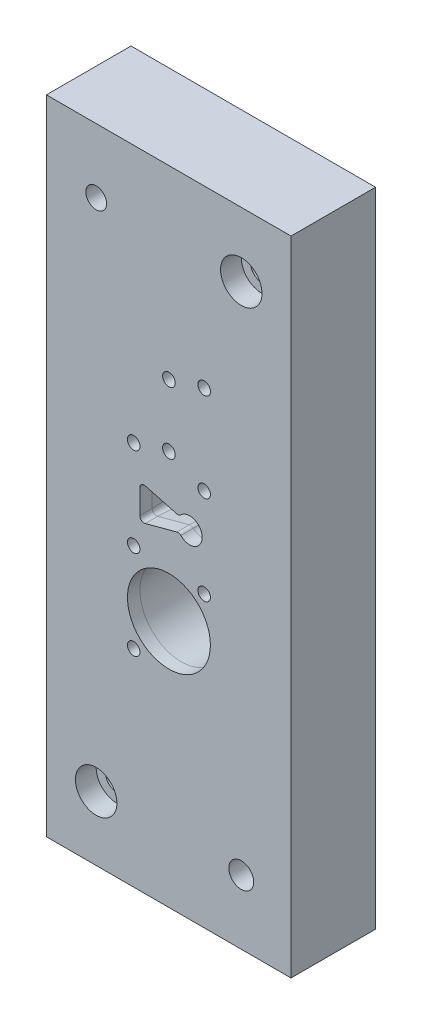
ISO-10303-21;
HEADER;
FILE_DESCRIPTION(('STEP AP214'),'2;1');
FILE_NAME('part.step','',(''),(''),'','','');
FILE_SCHEMA(('AUTOMOTIVE_DESIGN { 1 0 10303 214 1 1 1 1 }'));
ENDSEC;
DATA;
#1=APPLICATION_CONTEXT('core data for automotive mechanical design processes');
#2=APPLICATION_PROTOCOL_DEFINITION('international standard','automotive_design',2000,#1);
#3=PRODUCT_CONTEXT('',#1,'mechanical');
#4=PRODUCT('Part','Part','',(#3));
#5=PRODUCT_RELATED_PRODUCT_CATEGORY('part','',(#4));
#6=PRODUCT_DEFINITION_FORMATION('','',#4);
#7=PRODUCT_DEFINITION_CONTEXT('part definition',#1,'design');
#8=PRODUCT_DEFINITION('design','',#6,#7);
#9=PRODUCT_DEFINITION_SHAPE('','',#8);
#10=(LENGTH_UNIT() NAMED_UNIT(*) SI_UNIT(.MILLI.,.METRE.));
#11=(NAMED_UNIT(*) PLANE_ANGLE_UNIT() SI_UNIT($,.RADIAN.));
#12=(NAMED_UNIT(*) SI_UNIT($,.STERADIAN.) SOLID_ANGLE_UNIT());
#13=UNCERTAINTY_MEASURE_WITH_UNIT(LENGTH_MEASURE(1.E-05),#10,'distance_accuracy_value','');
#14=(GEOMETRIC_REPRESENTATION_CONTEXT(3) GLOBAL_UNCERTAINTY_ASSIGNED_CONTEXT((#13)) GLOBAL_UNIT_ASSIGNED_CONTEXT((#10,
#11,#12)) REPRESENTATION_CONTEXT('',''));
#15=CARTESIAN_POINT('',(0.,0.,0.));
#16=DIRECTION('',(0.,0.,1.));
#17=DIRECTION('',(1.,0.,0.));
#18=AXIS2_PLACEMENT_3D('',#15,#16,#17);
#19=CARTESIAN_POINT('',(29.5,77.5,20.4));
#20=DIRECTION('',(0.,0.,1.));
#21=DIRECTION('',(1.,0.,0.));
#22=AXIS2_PLACEMENT_3D('',#19,#20,#21);
#23=PLANE('',#22);
#24=CARTESIAN_POINT('',(-8.45000000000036,-27.667948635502,20.4));
#25=DIRECTION('',(0.,0.,1.));
#26=DIRECTION('',(1.,0.,0.));
#27=AXIS2_PLACEMENT_3D('',#24,#25,#26);
#28=CIRCLE('',#27,1.5035);
#29=CARTESIAN_POINT('',(-6.94650000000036,-27.667948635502,20.4));
#30=VERTEX_POINT('',#29);
#31=EDGE_CURVE('E558',#30,#30,#28,.T.);
#32=ORIENTED_EDGE('',*,*,#31,.F.);
#33=EDGE_LOOP('',(#32));
#34=FACE_BOUND('',#33,.T.);
#35=CARTESIAN_POINT('',(8.54999999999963,-7.7320513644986,20.4));
#36=DIRECTION('',(0.,0.,1.));
#37=DIRECTION('',(1.,0.,0.));
#38=AXIS2_PLACEMENT_3D('',#35,#36,#37);
#39=CIRCLE('',#38,1.5035);
#40=CARTESIAN_POINT('',(10.0534999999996,-7.7320513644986,20.4));
#41=VERTEX_POINT('',#40);
#42=EDGE_CURVE('E198',#41,#41,#39,.T.);
#43=ORIENTED_EDGE('',*,*,#42,.F.);
#44=EDGE_LOOP('',(#43));
#45=FACE_BOUND('',#44,.T.);
#46=CARTESIAN_POINT('',(2.22157287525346,6.62842712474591,20.4));
#47=DIRECTION('',(0.,0.,-1.));
#48=DIRECTION('',(1.,0.,0.));
#49=AXIS2_PLACEMENT_3D('',#46,#47,#48);
#50=CIRCLE('',#49,0.97);
#51=CARTESIAN_POINT('',(2.90746645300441,5.94253354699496,20.4));
#52=VERTEX_POINT('',#51);
#53=CARTESIAN_POINT('',(1.97051840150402,5.69147907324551,20.4));
#54=VERTEX_POINT('',#53);
#55=EDGE_CURVE('E56',#52,#54,#50,.T.);
#56=ORIENTED_EDGE('',*,*,#55,.F.);
#57=CARTESIAN_POINT('',(5.04999999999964,3.79999999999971,20.4));
#58=DIRECTION('',(0.,0.,1.));
#59=DIRECTION('',(1.,0.,0.));
#60=AXIS2_PLACEMENT_3D('',#57,#58,#59);
#61=CIRCLE('',#60,3.03);
#62=CARTESIAN_POINT('',(2.90746645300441,1.65746645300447,20.4));
#63=VERTEX_POINT('',#62);
#64=EDGE_CURVE('E166',#63,#52,#61,.T.);
#65=ORIENTED_EDGE('',*,*,#64,.F.);
#66=CARTESIAN_POINT('',(2.22157287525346,0.971572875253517,20.4));
#67=DIRECTION('',(0.,0.,-1.));
#68=DIRECTION('',(1.,0.,0.));
#69=AXIS2_PLACEMENT_3D('',#66,#67,#68);
#70=CIRCLE('',#69,0.97);
#71=CARTESIAN_POINT('',(1.97051840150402,1.90852092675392,20.4));
#72=VERTEX_POINT('',#71);
#73=EDGE_CURVE('E212',#72,#63,#70,.T.);
#74=ORIENTED_EDGE('',*,*,#73,.F.);
#75=DIRECTION('',(0.96592582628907,0.258819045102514,0.));
#76=VECTOR('',#75,1.);
#77=CARTESIAN_POINT('',(-5.68341638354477,-0.142344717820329,20.4));
#78=LINE('',#77,#76);
#79=CARTESIAN_POINT('',(-5.68341638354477,-0.142344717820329,20.4));
#80=VERTEX_POINT('',#79);
#81=EDGE_CURVE('E209',#80,#72,#78,.T.);
#82=ORIENTED_EDGE('',*,*,#81,.F.);
#83=CARTESIAN_POINT('',(-5.95000000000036,0.852558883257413,20.4));
#84=DIRECTION('',(0.,0.,1.));
#85=DIRECTION('',(1.,0.,0.));
#86=AXIS2_PLACEMENT_3D('',#83,#84,#85);
#87=CIRCLE('',#86,1.03);
#88=CARTESIAN_POINT('',(-6.98000000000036,0.852558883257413,20.4));
#89=VERTEX_POINT('',#88);
#90=EDGE_CURVE('E206',#89,#80,#87,.T.);
#91=ORIENTED_EDGE('',*,*,#90,.F.);
#92=DIRECTION('',(0.,-1.,0.));
#93=VECTOR('',#92,1.);
#94=CARTESIAN_POINT('',(-6.98000000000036,6.74744111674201,20.4));
#95=LINE('',#94,#93);
#96=CARTESIAN_POINT('',(-6.98000000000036,6.74744111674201,20.4));
#97=VERTEX_POINT('',#96);
#98=EDGE_CURVE('E203',#97,#89,#95,.T.);
#99=ORIENTED_EDGE('',*,*,#98,.F.);
#100=CARTESIAN_POINT('',(-5.95000000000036,6.74744111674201,20.4));
#101=DIRECTION('',(0.,0.,1.));
#102=DIRECTION('',(1.,0.,0.));
#103=AXIS2_PLACEMENT_3D('',#100,#101,#102);
#104=CIRCLE('',#103,1.03);
#105=CARTESIAN_POINT('',(-5.68341638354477,7.74234471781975,20.4));
#106=VERTEX_POINT('',#105);
#107=EDGE_CURVE('E200',#106,#97,#104,.T.);
#108=ORIENTED_EDGE('',*,*,#107,.F.);
#109=DIRECTION('',(-0.96592582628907,0.258819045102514,0.));
#110=VECTOR('',#109,1.);
#111=CARTESIAN_POINT('',(1.97051840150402,5.69147907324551,20.4));
#112=LINE('',#111,#110);
#113=EDGE_CURVE('E197',#54,#106,#112,.T.);
#114=ORIENTED_EDGE('',*,*,#113,.F.);
#115=EDGE_LOOP('',(#56,#65,#74,#82,#91,#99,#108,#114));
#116=FACE_BOUND('',#115,.T.);
#117=CARTESIAN_POINT('',(-8.45000000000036,-6.16794863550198,20.4));
#118=DIRECTION('',(0.,0.,1.));
#119=DIRECTION('',(1.,0.,0.));
#120=AXIS2_PLACEMENT_3D('',#117,#118,#119);
#121=CIRCLE('',#120,1.5035);
#122=CARTESIAN_POINT('',(-6.94650000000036,-6.16794863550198,20.4));
#123=VERTEX_POINT('',#122);
#124=EDGE_CURVE('E219',#123,#123,#121,.T.);
#125=ORIENTED_EDGE('',*,*,#124,.F.);
#126=EDGE_LOOP('',(#125));
#127=FACE_BOUND('',#126,.T.);
#128=CARTESIAN_POINT('',(8.54999999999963,13.7679486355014,20.4));
#129=DIRECTION('',(0.,0.,1.));
#130=DIRECTION('',(1.,0.,0.));
#131=AXIS2_PLACEMENT_3D('',#128,#129,#130);
#132=CIRCLE('',#131,1.5035);
#133=CARTESIAN_POINT('',(10.0534999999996,13.7679486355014,20.4));
#134=VERTEX_POINT('',#133);
#135=EDGE_CURVE('E233',#134,#134,#132,.T.);
#136=ORIENTED_EDGE('',*,*,#135,.F.);
#137=EDGE_LOOP('',(#136));
#138=FACE_BOUND('',#137,.T.);
#139=CARTESIAN_POINT('',(-8.45000000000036,15.332051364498,20.4));
#140=DIRECTION('',(0.,0.,1.));
#141=DIRECTION('',(1.,0.,0.));
#142=AXIS2_PLACEMENT_3D('',#139,#140,#141);
#143=CIRCLE('',#142,1.5285);
#144=CARTESIAN_POINT('',(-6.92150000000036,15.332051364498,20.4));
#145=VERTEX_POINT('',#144);
#146=EDGE_CURVE('E236',#145,#145,#143,.T.);
#147=ORIENTED_EDGE('',*,*,#146,.F.);
#148=EDGE_LOOP('',(#147));
#149=FACE_BOUND('',#148,.T.);
#150=CARTESIAN_POINT('',(0.0499999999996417,17.7999999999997,20.4));
#151=DIRECTION('',(0.,0.,1.));
#152=DIRECTION('',(1.,0.,0.));
#153=AXIS2_PLACEMENT_3D('',#150,#151,#152);
#154=CIRCLE('',#153,1.5285);
#155=CARTESIAN_POINT('',(1.57849999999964,17.7999999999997,20.4));
#156=VERTEX_POINT('',#155);
#157=EDGE_CURVE('E239',#156,#156,#154,.T.);
#158=ORIENTED_EDGE('',*,*,#157,.F.);
#159=EDGE_LOOP('',(#158));
#160=FACE_BOUND('',#159,.T.);
#161=CARTESIAN_POINT('',(0.0499999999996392,32.7999999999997,20.4));
#162=DIRECTION('',(0.,0.,1.));
#163=DIRECTION('',(1.,0.,0.));
#164=AXIS2_PLACEMENT_3D('',#161,#162,#163);
#165=CIRCLE('',#164,1.5285);
#166=CARTESIAN_POINT('',(1.57849999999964,32.7999999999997,20.4));
#167=VERTEX_POINT('',#166);
#168=EDGE_CURVE('E242',#167,#167,#165,.T.);
#169=ORIENTED_EDGE('',*,*,#168,.F.);
#170=EDGE_LOOP('',(#169));
#171=FACE_BOUND('',#170,.T.);
#172=CARTESIAN_POINT('',(8.54999999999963,35.2679486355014,20.4));
#173=DIRECTION('',(0.,0.,1.));
#174=DIRECTION('',(1.,0.,0.));
#175=AXIS2_PLACEMENT_3D('',#172,#173,#174);
#176=CIRCLE('',#175,1.5285);
#177=CARTESIAN_POINT('',(10.0784999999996,35.2679486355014,20.4));
#178=VERTEX_POINT('',#177);
#179=EDGE_CURVE('E245',#178,#178,#176,.T.);
#180=ORIENTED_EDGE('',*,*,#179,.F.);
#181=EDGE_LOOP('',(#180));
#182=FACE_BOUND('',#181,.T.);
#183=CARTESIAN_POINT('',(0.0499999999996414,-17.7000000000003,20.4));
#184=DIRECTION('',(0.,0.,1.));
#185=DIRECTION('',(1.,0.,0.));
#186=AXIS2_PLACEMENT_3D('',#183,#184,#185);
#187=CIRCLE('',#186,10.);
#188=CARTESIAN_POINT('',(10.0499999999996,-17.7000000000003,20.4));
#189=VERTEX_POINT('',#188);
#190=EDGE_CURVE('E248',#189,#189,#187,.T.);
#191=ORIENTED_EDGE('',*,*,#190,.F.);
#192=EDGE_LOOP('',(#191));
#193=FACE_BOUND('',#192,.T.);
#194=CARTESIAN_POINT('',(17.5,62.,20.4));
#195=DIRECTION('',(0.,0.,1.));
#196=DIRECTION('',(1.,0.,0.));
#197=AXIS2_PLACEMENT_3D('',#194,#195,#196);
#198=CIRCLE('',#197,4.99999999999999);
#199=CARTESIAN_POINT('',(22.5,62.,20.4));
#200=VERTEX_POINT('',#199);
#201=EDGE_CURVE('E260',#200,#200,#198,.T.);
#202=ORIENTED_EDGE('',*,*,#201,.F.);
#203=EDGE_LOOP('',(#202));
#204=FACE_BOUND('',#203,.T.);
#205=CARTESIAN_POINT('',(-17.5,-62.,20.4));
#206=DIRECTION('',(0.,0.,1.));
#207=DIRECTION('',(1.,0.,0.));
#208=AXIS2_PLACEMENT_3D('',#205,#206,#207);
#209=CIRCLE('',#208,4.99999999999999);
#210=CARTESIAN_POINT('',(-12.5,-62.,20.4));
#211=VERTEX_POINT('',#210);
#212=EDGE_CURVE('E272',#211,#211,#209,.T.);
#213=ORIENTED_EDGE('',*,*,#212,.F.);
#214=EDGE_LOOP('',(#213));
#215=FACE_BOUND('',#214,.T.);
#216=CARTESIAN_POINT('',(-17.5,62.,20.4));
#217=DIRECTION('',(0.,0.,1.));
#218=DIRECTION('',(1.,0.,0.));
#219=AXIS2_PLACEMENT_3D('',#216,#217,#218);
#220=CIRCLE('',#219,2.5035);
#221=CARTESIAN_POINT('',(-14.9965,62.,20.4));
#222=VERTEX_POINT('',#221);
#223=EDGE_CURVE('E284',#222,#222,#220,.T.);
#224=ORIENTED_EDGE('',*,*,#223,.F.);
#225=EDGE_LOOP('',(#224));
#226=FACE_BOUND('',#225,.T.);
#227=DIRECTION('',(0.,1.,0.));
#228=VECTOR('',#227,1.);
#229=CARTESIAN_POINT('',(29.5,-77.5,20.4));
#230=LINE('',#229,#228);
#231=CARTESIAN_POINT('',(29.5,-77.5,20.4));
#232=VERTEX_POINT('',#231);
#233=CARTESIAN_POINT('',(29.5,77.5,20.4));
#234=VERTEX_POINT('',#233);
#235=EDGE_CURVE('E296',#232,#234,#230,.T.);
#236=ORIENTED_EDGE('',*,*,#235,.T.);
#237=DIRECTION('',(-1.,0.,0.));
#238=VECTOR('',#237,1.);
#239=CARTESIAN_POINT('',(29.5,77.5,20.4));
#240=LINE('',#239,#238);
#241=CARTESIAN_POINT('',(-29.5,77.5,20.4));
#242=VERTEX_POINT('',#241);
#243=EDGE_CURVE('E299',#234,#242,#240,.T.);
#244=ORIENTED_EDGE('',*,*,#243,.T.);
#245=DIRECTION('',(0.,-1.,0.));
#246=VECTOR('',#245,1.);
#247=CARTESIAN_POINT('',(-29.5,-77.5,20.4));
#248=LINE('',#247,#246);
#249=CARTESIAN_POINT('',(-29.5,-77.5,20.4));
#250=VERTEX_POINT('',#249);
#251=EDGE_CURVE('E301',#242,#250,#248,.T.);
#252=ORIENTED_EDGE('',*,*,#251,.T.);
#253=DIRECTION('',(1.,0.,0.));
#254=VECTOR('',#253,1.);
#255=CARTESIAN_POINT('',(-29.5,-77.5,20.4));
#256=LINE('',#255,#254);
#257=EDGE_CURVE('E303',#250,#232,#256,.T.);
#258=ORIENTED_EDGE('',*,*,#257,.T.);
#259=EDGE_LOOP('',(#236,#244,#252,#258));
#260=FACE_BOUND('',#259,.T.);
#261=CARTESIAN_POINT('',(17.5,-62.,20.4));
#262=DIRECTION('',(0.,0.,1.));
#263=DIRECTION('',(1.,0.,0.));
#264=AXIS2_PLACEMENT_3D('',#261,#262,#263);
#265=CIRCLE('',#264,3.0035);
#266=CARTESIAN_POINT('',(20.5035,-62.,20.4));
#267=VERTEX_POINT('',#266);
#268=EDGE_CURVE('E278',#267,#267,#265,.T.);
#269=ORIENTED_EDGE('',*,*,#268,.F.);
#270=EDGE_LOOP('',(#269));
#271=FACE_BOUND('',#270,.T.);
#272=ADVANCED_FACE('F33',(#34,#45,#116,#127,#138,#149,#160,#171,#182,#193,#204,#215,#226,#260,
#271),#23,.T.);
#273=CARTESIAN_POINT('',(29.5,77.5,0.));
#274=DIRECTION('',(0.,0.,1.));
#275=DIRECTION('',(1.,0.,0.));
#276=AXIS2_PLACEMENT_3D('',#273,#274,#275);
#277=PLANE('',#276);
#278=CARTESIAN_POINT('',(-8.45000000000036,-27.667948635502,0.));
#279=DIRECTION('',(0.,0.,1.));
#280=DIRECTION('',(1.,0.,0.));
#281=AXIS2_PLACEMENT_3D('',#278,#279,#280);
#282=CIRCLE('',#281,1.5035);
#283=CARTESIAN_POINT('',(-6.94650000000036,-27.667948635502,0.));
#284=VERTEX_POINT('',#283);
#285=EDGE_CURVE('E667',#284,#284,#282,.T.);
#286=ORIENTED_EDGE('',*,*,#285,.T.);
#287=EDGE_LOOP('',(#286));
#288=FACE_BOUND('',#287,.T.);
#289=CARTESIAN_POINT('',(8.54999999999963,-7.7320513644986,0.));
#290=DIRECTION('',(0.,0.,1.));
#291=DIRECTION('',(1.,0.,0.));
#292=AXIS2_PLACEMENT_3D('',#289,#290,#291);
#293=CIRCLE('',#292,1.5035);
#294=CARTESIAN_POINT('',(10.0534999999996,-7.7320513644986,0.));
#295=VERTEX_POINT('',#294);
#296=EDGE_CURVE('E665',#295,#295,#293,.T.);
#297=ORIENTED_EDGE('',*,*,#296,.T.);
#298=EDGE_LOOP('',(#297));
#299=FACE_BOUND('',#298,.T.);
#300=CARTESIAN_POINT('',(-8.45000000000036,-6.16794863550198,0.));
#301=DIRECTION('',(0.,0.,1.));
#302=DIRECTION('',(1.,0.,0.));
#303=AXIS2_PLACEMENT_3D('',#300,#301,#302);
#304=CIRCLE('',#303,1.5035);
#305=CARTESIAN_POINT('',(-6.94650000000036,-6.16794863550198,0.));
#306=VERTEX_POINT('',#305);
#307=EDGE_CURVE('E513',#306,#306,#304,.T.);
#308=ORIENTED_EDGE('',*,*,#307,.T.);
#309=EDGE_LOOP('',(#308));
#310=FACE_BOUND('',#309,.T.);
#311=CARTESIAN_POINT('',(8.54999999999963,13.7679486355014,0.));
#312=DIRECTION('',(0.,0.,1.));
#313=DIRECTION('',(1.,0.,0.));
#314=AXIS2_PLACEMENT_3D('',#311,#312,#313);
#315=CIRCLE('',#314,1.5035);
#316=CARTESIAN_POINT('',(10.0534999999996,13.7679486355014,0.));
#317=VERTEX_POINT('',#316);
#318=EDGE_CURVE('E508',#317,#317,#315,.T.);
#319=ORIENTED_EDGE('',*,*,#318,.T.);
#320=EDGE_LOOP('',(#319));
#321=FACE_BOUND('',#320,.T.);
#322=CARTESIAN_POINT('',(8.54999999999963,35.2679486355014,0.));
#323=DIRECTION('',(0.,0.,1.));
#324=DIRECTION('',(1.,0.,0.));
#325=AXIS2_PLACEMENT_3D('',#322,#323,#324);
#326=CIRCLE('',#325,2.44039535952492);
#327=CARTESIAN_POINT('',(10.9903953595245,35.2679486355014,0.));
#328=VERTEX_POINT('',#327);
#329=EDGE_CURVE('E504',#328,#328,#326,.T.);
#330=ORIENTED_EDGE('',*,*,#329,.T.);
#331=EDGE_LOOP('',(#330));
#332=FACE_BOUND('',#331,.T.);
#333=CARTESIAN_POINT('',(0.0499999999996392,32.7999999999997,0.));
#334=DIRECTION('',(0.,0.,1.));
#335=DIRECTION('',(1.,0.,0.));
#336=AXIS2_PLACEMENT_3D('',#333,#334,#335);
#337=CIRCLE('',#336,2.44039535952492);
#338=CARTESIAN_POINT('',(2.49039535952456,32.7999999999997,0.));
#339=VERTEX_POINT('',#338);
#340=EDGE_CURVE('E519',#339,#339,#337,.T.);
#341=ORIENTED_EDGE('',*,*,#340,.T.);
#342=EDGE_LOOP('',(#341));
#343=FACE_BOUND('',#342,.T.);
#344=CARTESIAN_POINT('',(-8.45000000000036,15.332051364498,0.));
#345=DIRECTION('',(0.,0.,1.));
#346=DIRECTION('',(1.,0.,0.));
#347=AXIS2_PLACEMENT_3D('',#344,#345,#346);
#348=CIRCLE('',#347,2.44039535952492);
#349=CARTESIAN_POINT('',(-6.00960464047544,15.332051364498,0.));
#350=VERTEX_POINT('',#349);
#351=EDGE_CURVE('E525',#350,#350,#348,.T.);
#352=ORIENTED_EDGE('',*,*,#351,.T.);
#353=EDGE_LOOP('',(#352));
#354=FACE_BOUND('',#353,.T.);
#355=CARTESIAN_POINT('',(0.0499999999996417,17.7999999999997,0.));
#356=DIRECTION('',(0.,0.,1.));
#357=DIRECTION('',(1.,0.,0.));
#358=AXIS2_PLACEMENT_3D('',#355,#356,#357);
#359=CIRCLE('',#358,2.44039535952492);
#360=CARTESIAN_POINT('',(2.49039535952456,17.7999999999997,0.));
#361=VERTEX_POINT('',#360);
#362=EDGE_CURVE('E531',#361,#361,#359,.T.);
#363=ORIENTED_EDGE('',*,*,#362,.T.);
#364=EDGE_LOOP('',(#363));
#365=FACE_BOUND('',#364,.T.);
#366=CARTESIAN_POINT('',(0.0499999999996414,-17.7000000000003,0.));
#367=DIRECTION('',(0.,0.,1.));
#368=DIRECTION('',(1.,0.,0.));
#369=AXIS2_PLACEMENT_3D('',#366,#367,#368);
#370=CIRCLE('',#369,10.9118953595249);
#371=CARTESIAN_POINT('',(10.9618953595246,-17.7000000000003,0.));
#372=VERTEX_POINT('',#371);
#373=EDGE_CURVE('E537',#372,#372,#370,.T.);
#374=ORIENTED_EDGE('',*,*,#373,.T.);
#375=EDGE_LOOP('',(#374));
#376=FACE_BOUND('',#375,.T.);
#377=CARTESIAN_POINT('',(5.04999999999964,3.79999999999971,0.));
#378=DIRECTION('',(0.,0.,1.));
#379=DIRECTION('',(1.,0.,0.));
#380=AXIS2_PLACEMENT_3D('',#377,#378,#379);
#381=CIRCLE('',#380,3.94189535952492);
#382=CARTESIAN_POINT('',(2.26265906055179,1.01265906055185,0.));
#383=VERTEX_POINT('',#382);
#384=CARTESIAN_POINT('',(2.26265906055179,6.58734093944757,0.));
#385=VERTEX_POINT('',#384);
#386=EDGE_CURVE('E159',#383,#385,#381,.T.);
#387=ORIENTED_EDGE('',*,*,#386,.T.);
#388=CARTESIAN_POINT('',(2.22157287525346,6.62842712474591,0.));
#389=DIRECTION('',(0.,0.,1.));
#390=DIRECTION('',(1.,0.,0.));
#391=AXIS2_PLACEMENT_3D('',#388,#389,#390);
#392=CIRCLE('',#391,0.0581046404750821);
#393=CARTESIAN_POINT('',(2.20653428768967,6.57230235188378,0.));
#394=VERTEX_POINT('',#393);
#395=EDGE_CURVE('E540',#385,#394,#392,.F.);
#396=ORIENTED_EDGE('',*,*,#395,.T.);
#397=DIRECTION('',(-0.96592582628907,0.258819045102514,0.));
#398=VECTOR('',#397,1.);
#399=CARTESIAN_POINT('',(2.20653428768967,6.57230235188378,0.));
#400=LINE('',#399,#398);
#401=CARTESIAN_POINT('',(-5.44740049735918,8.62316799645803,0.));
#402=VERTEX_POINT('',#401);
#403=EDGE_CURVE('E154',#394,#402,#400,.T.);
#404=ORIENTED_EDGE('',*,*,#403,.T.);
#405=CARTESIAN_POINT('',(-5.95000000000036,6.74744111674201,0.));
#406=DIRECTION('',(0.,0.,1.));
#407=DIRECTION('',(1.,0.,0.));
#408=AXIS2_PLACEMENT_3D('',#405,#406,#407);
#409=CIRCLE('',#408,1.94189535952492);
#410=CARTESIAN_POINT('',(-7.89189535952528,6.74744111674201,0.));
#411=VERTEX_POINT('',#410);
#412=EDGE_CURVE('E48',#402,#411,#409,.T.);
#413=ORIENTED_EDGE('',*,*,#412,.T.);
#414=DIRECTION('',(0.,-1.,0.));
#415=VECTOR('',#414,1.);
#416=CARTESIAN_POINT('',(-7.89189535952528,6.6284271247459,0.));
#417=LINE('',#416,#415);
#418=CARTESIAN_POINT('',(-7.89189535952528,0.852558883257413,0.));
#419=VERTEX_POINT('',#418);
#420=EDGE_CURVE('E553',#411,#419,#417,.T.);
#421=ORIENTED_EDGE('',*,*,#420,.T.);
#422=CARTESIAN_POINT('',(-5.95000000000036,0.852558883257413,0.));
#423=DIRECTION('',(0.,0.,1.));
#424=DIRECTION('',(1.,0.,0.));
#425=AXIS2_PLACEMENT_3D('',#422,#423,#424);
#426=CIRCLE('',#425,1.94189535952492);
#427=CARTESIAN_POINT('',(-5.44740049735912,-1.0231679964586,0.));
#428=VERTEX_POINT('',#427);
#429=EDGE_CURVE('E550',#419,#428,#426,.T.);
#430=ORIENTED_EDGE('',*,*,#429,.T.);
#431=DIRECTION('',(0.96592582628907,0.258819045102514,0.));
#432=VECTOR('',#431,1.);
#433=CARTESIAN_POINT('',(3.62074785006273,1.40663503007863,0.));
#434=LINE('',#433,#432);
#435=CARTESIAN_POINT('',(2.20653428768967,1.02769764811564,0.));
#436=VERTEX_POINT('',#435);
#437=EDGE_CURVE('E547',#428,#436,#434,.T.);
#438=ORIENTED_EDGE('',*,*,#437,.T.);
#439=CARTESIAN_POINT('',(2.22157287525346,0.971572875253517,0.));
#440=DIRECTION('',(0.,0.,1.));
#441=DIRECTION('',(1.,0.,0.));
#442=AXIS2_PLACEMENT_3D('',#439,#440,#441);
#443=CIRCLE('',#442,0.0581046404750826);
#444=EDGE_CURVE('E544',#436,#383,#443,.F.);
#445=ORIENTED_EDGE('',*,*,#444,.T.);
#446=EDGE_LOOP('',(#387,#396,#404,#413,#421,#430,#438,#445));
#447=FACE_BOUND('',#446,.T.);
#448=CARTESIAN_POINT('',(17.5,62.,0.));
#449=DIRECTION('',(0.,0.,1.));
#450=DIRECTION('',(1.,0.,0.));
#451=AXIS2_PLACEMENT_3D('',#448,#449,#450);
#452=CIRCLE('',#451,2.75);
#453=CARTESIAN_POINT('',(20.25,62.,0.));
#454=VERTEX_POINT('',#453);
#455=EDGE_CURVE('E251',#454,#454,#452,.T.);
#456=ORIENTED_EDGE('',*,*,#455,.T.);
#457=EDGE_LOOP('',(#456));
#458=FACE_BOUND('',#457,.T.);
#459=CARTESIAN_POINT('',(-17.5,-62.,0.));
#460=DIRECTION('',(0.,0.,1.));
#461=DIRECTION('',(1.,0.,0.));
#462=AXIS2_PLACEMENT_3D('',#459,#460,#461);
#463=CIRCLE('',#462,2.75);
#464=CARTESIAN_POINT('',(-14.75,-62.,0.));
#465=VERTEX_POINT('',#464);
#466=EDGE_CURVE('E263',#465,#465,#463,.T.);
#467=ORIENTED_EDGE('',*,*,#466,.T.);
#468=EDGE_LOOP('',(#467));
#469=FACE_BOUND('',#468,.T.);
#470=CARTESIAN_POINT('',(-17.5,62.,0.));
#471=DIRECTION('',(0.,0.,1.));
#472=DIRECTION('',(1.,0.,0.));
#473=AXIS2_PLACEMENT_3D('',#470,#471,#472);
#474=CIRCLE('',#473,2.5035);
#475=CARTESIAN_POINT('',(-14.9965,62.,0.));
#476=VERTEX_POINT('',#475);
#477=EDGE_CURVE('E281',#476,#476,#474,.T.);
#478=ORIENTED_EDGE('',*,*,#477,.T.);
#479=EDGE_LOOP('',(#478));
#480=FACE_BOUND('',#479,.T.);
#481=DIRECTION('',(0.,1.,0.));
#482=VECTOR('',#481,1.);
#483=CARTESIAN_POINT('',(29.5,-77.5,0.));
#484=LINE('',#483,#482);
#485=CARTESIAN_POINT('',(29.5,-77.5,0.));
#486=VERTEX_POINT('',#485);
#487=CARTESIAN_POINT('',(29.5,77.5,0.));
#488=VERTEX_POINT('',#487);
#489=EDGE_CURVE('E287',#486,#488,#484,.T.);
#490=ORIENTED_EDGE('',*,*,#489,.F.);
#491=DIRECTION('',(1.,0.,0.));
#492=VECTOR('',#491,1.);
#493=CARTESIAN_POINT('',(-29.5,-77.5,0.));
#494=LINE('',#493,#492);
#495=CARTESIAN_POINT('',(-29.5,-77.5,0.));
#496=VERTEX_POINT('',#495);
#497=EDGE_CURVE('E294',#496,#486,#494,.T.);
#498=ORIENTED_EDGE('',*,*,#497,.F.);
#499=DIRECTION('',(0.,-1.,0.));
#500=VECTOR('',#499,1.);
#501=CARTESIAN_POINT('',(-29.5,-77.5,0.));
#502=LINE('',#501,#500);
#503=CARTESIAN_POINT('',(-29.5,77.5,0.));
#504=VERTEX_POINT('',#503);
#505=EDGE_CURVE('E292',#504,#496,#502,.T.);
#506=ORIENTED_EDGE('',*,*,#505,.F.);
#507=DIRECTION('',(-1.,0.,0.));
#508=VECTOR('',#507,1.);
#509=CARTESIAN_POINT('',(29.5,77.5,0.));
#510=LINE('',#509,#508);
#511=EDGE_CURVE('E290',#488,#504,#510,.T.);
#512=ORIENTED_EDGE('',*,*,#511,.F.);
#513=EDGE_LOOP('',(#490,#498,#506,#512));
#514=FACE_BOUND('',#513,.T.);
#515=CARTESIAN_POINT('',(17.5,-62.,0.));
#516=DIRECTION('',(0.,0.,1.));
#517=DIRECTION('',(1.,0.,0.));
#518=AXIS2_PLACEMENT_3D('',#515,#516,#517);
#519=CIRCLE('',#518,3.0035);
#520=CARTESIAN_POINT('',(20.5035,-62.,0.));
#521=VERTEX_POINT('',#520);
#522=EDGE_CURVE('E275',#521,#521,#519,.T.);
#523=ORIENTED_EDGE('',*,*,#522,.T.);
#524=EDGE_LOOP('',(#523));
#525=FACE_BOUND('',#524,.T.);
#526=ADVANCED_FACE('F321',(#288,#299,#310,#321,#332,#343,#354,#365,#376,#447,#458,#469,#480,
#514,#525),#277,.F.);
#527=CARTESIAN_POINT('',(29.5,-77.5,20.4));
#528=DIRECTION('',(-1.,0.,0.));
#529=DIRECTION('',(0.,0.,1.));
#530=AXIS2_PLACEMENT_3D('',#527,#528,#529);
#531=PLANE('',#530);
#532=ORIENTED_EDGE('',*,*,#489,.T.);
#533=DIRECTION('',(0.,0.,-1.));
#534=VECTOR('',#533,1.);
#535=CARTESIAN_POINT('',(29.5,77.5,20.4));
#536=LINE('',#535,#534);
#537=EDGE_CURVE('E11',#234,#488,#536,.T.);
#538=ORIENTED_EDGE('',*,*,#537,.F.);
#539=ORIENTED_EDGE('',*,*,#235,.F.);
#540=DIRECTION('',(0.,0.,-1.));
#541=VECTOR('',#540,1.);
#542=CARTESIAN_POINT('',(29.5,-77.5,20.4));
#543=LINE('',#542,#541);
#544=EDGE_CURVE('E305',#232,#486,#543,.T.);
#545=ORIENTED_EDGE('',*,*,#544,.T.);
#546=EDGE_LOOP('',(#532,#538,#539,#545));
#547=FACE_BOUND('',#546,.T.);
#548=ADVANCED_FACE('F35',(#547),#531,.F.);
#549=CARTESIAN_POINT('',(29.5,77.5,20.4));
#550=DIRECTION('',(0.,-1.,0.));
#551=DIRECTION('',(0.,0.,-1.));
#552=AXIS2_PLACEMENT_3D('',#549,#550,#551);
#553=PLANE('',#552);
#554=ORIENTED_EDGE('',*,*,#511,.T.);
#555=DIRECTION('',(0.,0.,-1.));
#556=VECTOR('',#555,1.);
#557=CARTESIAN_POINT('',(-29.5,77.5,20.4));
#558=LINE('',#557,#556);
#559=EDGE_CURVE('E41',#242,#504,#558,.T.);
#560=ORIENTED_EDGE('',*,*,#559,.F.);
#561=ORIENTED_EDGE('',*,*,#243,.F.);
#562=ORIENTED_EDGE('',*,*,#537,.T.);
#563=EDGE_LOOP('',(#554,#560,#561,#562));
#564=FACE_BOUND('',#563,.T.);
#565=ADVANCED_FACE('F332',(#564),#553,.F.);
#566=CARTESIAN_POINT('',(-29.5,-77.5,20.4));
#567=DIRECTION('',(1.,0.,0.));
#568=DIRECTION('',(0.,0.,-1.));
#569=AXIS2_PLACEMENT_3D('',#566,#567,#568);
#570=PLANE('',#569);
#571=ORIENTED_EDGE('',*,*,#505,.T.);
#572=DIRECTION('',(0.,0.,-1.));
#573=VECTOR('',#572,1.);
#574=CARTESIAN_POINT('',(-29.5,-77.5,20.4));
#575=LINE('',#574,#573);
#576=EDGE_CURVE('E308',#250,#496,#575,.T.);
#577=ORIENTED_EDGE('',*,*,#576,.F.);
#578=ORIENTED_EDGE('',*,*,#251,.F.);
#579=ORIENTED_EDGE('',*,*,#559,.T.);
#580=EDGE_LOOP('',(#571,#577,#578,#579));
#581=FACE_BOUND('',#580,.T.);
#582=ADVANCED_FACE('F315',(#581),#570,.F.);
#583=CARTESIAN_POINT('',(-29.5,-77.5,20.4));
#584=DIRECTION('',(0.,1.,0.));
#585=DIRECTION('',(0.,0.,1.));
#586=AXIS2_PLACEMENT_3D('',#583,#584,#585);
#587=PLANE('',#586);
#588=ORIENTED_EDGE('',*,*,#497,.T.);
#589=ORIENTED_EDGE('',*,*,#544,.F.);
#590=ORIENTED_EDGE('',*,*,#257,.F.);
#591=ORIENTED_EDGE('',*,*,#576,.T.);
#592=EDGE_LOOP('',(#588,#589,#590,#591));
#593=FACE_BOUND('',#592,.T.);
#594=ADVANCED_FACE('F325',(#593),#587,.F.);
#595=CARTESIAN_POINT('',(-17.5,62.,20.4));
#596=DIRECTION('',(0.,0.,-1.));
#597=DIRECTION('',(-1.,0.,0.));
#598=AXIS2_PLACEMENT_3D('',#595,#596,#597);
#599=CYLINDRICAL_SURFACE('',#598,2.5035);
#600=ORIENTED_EDGE('',*,*,#223,.T.);
#601=EDGE_LOOP('',(#600));
#602=FACE_BOUND('',#601,.T.);
#603=ORIENTED_EDGE('',*,*,#477,.F.);
#604=EDGE_LOOP('',(#603));
#605=FACE_BOUND('',#604,.T.);
#606=ADVANCED_FACE('F352',(#602,#605),#599,.F.);
#607=CARTESIAN_POINT('',(17.5,-62.,20.4));
#608=DIRECTION('',(0.,0.,-1.));
#609=DIRECTION('',(-1.,0.,0.));
#610=AXIS2_PLACEMENT_3D('',#607,#608,#609);
#611=CYLINDRICAL_SURFACE('',#610,3.0035);
#612=ORIENTED_EDGE('',*,*,#268,.T.);
#613=EDGE_LOOP('',(#612));
#614=FACE_BOUND('',#613,.T.);
#615=ORIENTED_EDGE('',*,*,#522,.F.);
#616=EDGE_LOOP('',(#615));
#617=FACE_BOUND('',#616,.T.);
#618=ADVANCED_FACE('F356',(#614,#617),#611,.F.);
#619=CARTESIAN_POINT('',(-17.5,-62.,20.4));
#620=DIRECTION('',(0.,0.,1.));
#621=DIRECTION('',(1.,0.,0.));
#622=AXIS2_PLACEMENT_3D('',#619,#620,#621);
#623=CYLINDRICAL_SURFACE('',#622,4.99999999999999);
#624=CARTESIAN_POINT('',(-17.5,-62.,15.4));
#625=DIRECTION('',(0.,0.,1.));
#626=DIRECTION('',(1.,0.,0.));
#627=AXIS2_PLACEMENT_3D('',#624,#625,#626);
#628=CIRCLE('',#627,4.99999999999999);
#629=CARTESIAN_POINT('',(-12.5,-62.,15.4));
#630=VERTEX_POINT('',#629);
#631=EDGE_CURVE('E269',#630,#630,#628,.T.);
#632=ORIENTED_EDGE('',*,*,#631,.F.);
#633=EDGE_LOOP('',(#632));
#634=FACE_BOUND('',#633,.T.);
#635=ORIENTED_EDGE('',*,*,#212,.T.);
#636=EDGE_LOOP('',(#635));
#637=FACE_BOUND('',#636,.T.);
#638=ADVANCED_FACE('F361',(#634,#637),#623,.F.);
#639=CARTESIAN_POINT('',(-14.75,-62.,15.4));
#640=DIRECTION('',(0.,0.,-1.));
#641=DIRECTION('',(-1.,0.,0.));
#642=AXIS2_PLACEMENT_3D('',#639,#640,#641);
#643=PLANE('',#642);
#644=CARTESIAN_POINT('',(-17.5,-62.,15.4));
#645=DIRECTION('',(0.,0.,1.));
#646=DIRECTION('',(1.,0.,0.));
#647=AXIS2_PLACEMENT_3D('',#644,#645,#646);
#648=CIRCLE('',#647,2.75000000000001);
#649=CARTESIAN_POINT('',(-14.75,-62.,15.4));
#650=VERTEX_POINT('',#649);
#651=EDGE_CURVE('E266',#650,#650,#648,.T.);
#652=ORIENTED_EDGE('',*,*,#651,.F.);
#653=EDGE_LOOP('',(#652));
#654=FACE_BOUND('',#653,.T.);
#655=ORIENTED_EDGE('',*,*,#631,.T.);
#656=EDGE_LOOP('',(#655));
#657=FACE_BOUND('',#656,.T.);
#658=ADVANCED_FACE('F368',(#654,#657),#643,.F.);
#659=CARTESIAN_POINT('',(-17.5,-62.,20.4));
#660=DIRECTION('',(0.,0.,1.));
#661=DIRECTION('',(1.,0.,0.));
#662=AXIS2_PLACEMENT_3D('',#659,#660,#661);
#663=CYLINDRICAL_SURFACE('',#662,2.75);
#664=ORIENTED_EDGE('',*,*,#466,.F.);
#665=EDGE_LOOP('',(#664));
#666=FACE_BOUND('',#665,.T.);
#667=ORIENTED_EDGE('',*,*,#651,.T.);
#668=EDGE_LOOP('',(#667));
#669=FACE_BOUND('',#668,.T.);
#670=ADVANCED_FACE('F372',(#666,#669),#663,.F.);
#671=CARTESIAN_POINT('',(17.5,62.,20.4));
#672=DIRECTION('',(0.,0.,1.));
#673=DIRECTION('',(1.,0.,0.));
#674=AXIS2_PLACEMENT_3D('',#671,#672,#673);
#675=CYLINDRICAL_SURFACE('',#674,4.99999999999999);
#676=CARTESIAN_POINT('',(17.5,62.,15.4));
#677=DIRECTION('',(0.,0.,1.));
#678=DIRECTION('',(1.,0.,0.));
#679=AXIS2_PLACEMENT_3D('',#676,#677,#678);
#680=CIRCLE('',#679,4.99999999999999);
#681=CARTESIAN_POINT('',(22.5,62.,15.4));
#682=VERTEX_POINT('',#681);
#683=EDGE_CURVE('E257',#682,#682,#680,.T.);
#684=ORIENTED_EDGE('',*,*,#683,.F.);
#685=EDGE_LOOP('',(#684));
#686=FACE_BOUND('',#685,.T.);
#687=ORIENTED_EDGE('',*,*,#201,.T.);
#688=EDGE_LOOP('',(#687));
#689=FACE_BOUND('',#688,.T.);
#690=ADVANCED_FACE('F376',(#686,#689),#675,.F.);
#691=CARTESIAN_POINT('',(20.25,62.,15.4));
#692=DIRECTION('',(0.,0.,-1.));
#693=DIRECTION('',(-1.,0.,0.));
#694=AXIS2_PLACEMENT_3D('',#691,#692,#693);
#695=PLANE('',#694);
#696=CARTESIAN_POINT('',(17.5,62.,15.4));
#697=DIRECTION('',(0.,0.,1.));
#698=DIRECTION('',(1.,0.,0.));
#699=AXIS2_PLACEMENT_3D('',#696,#697,#698);
#700=CIRCLE('',#699,2.75000000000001);
#701=CARTESIAN_POINT('',(20.25,62.,15.4));
#702=VERTEX_POINT('',#701);
#703=EDGE_CURVE('E254',#702,#702,#700,.T.);
#704=ORIENTED_EDGE('',*,*,#703,.F.);
#705=EDGE_LOOP('',(#704));
#706=FACE_BOUND('',#705,.T.);
#707=ORIENTED_EDGE('',*,*,#683,.T.);
#708=EDGE_LOOP('',(#707));
#709=FACE_BOUND('',#708,.T.);
#710=ADVANCED_FACE('F380',(#706,#709),#695,.F.);
#711=CARTESIAN_POINT('',(17.5,62.,20.4));
#712=DIRECTION('',(0.,0.,1.));
#713=DIRECTION('',(1.,0.,0.));
#714=AXIS2_PLACEMENT_3D('',#711,#712,#713);
#715=CYLINDRICAL_SURFACE('',#714,2.75);
#716=ORIENTED_EDGE('',*,*,#455,.F.);
#717=EDGE_LOOP('',(#716));
#718=FACE_BOUND('',#717,.T.);
#719=ORIENTED_EDGE('',*,*,#703,.T.);
#720=EDGE_LOOP('',(#719));
#721=FACE_BOUND('',#720,.T.);
#722=ADVANCED_FACE('F384',(#718,#721),#715,.F.);
#723=CARTESIAN_POINT('',(0.0499999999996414,-17.7000000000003,17.4));
#724=DIRECTION('',(0.,0.,1.));
#725=DIRECTION('',(1.,0.,0.));
#726=AXIS2_PLACEMENT_3D('',#723,#724,#725);
#727=CYLINDRICAL_SURFACE('',#726,10.);
#728=CARTESIAN_POINT('',(0.0499999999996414,-17.7000000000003,17.4));
#729=DIRECTION('',(0.,0.,1.));
#730=DIRECTION('',(1.,0.,0.));
#731=AXIS2_PLACEMENT_3D('',#728,#729,#730);
#732=CIRCLE('',#731,10.);
#733=CARTESIAN_POINT('',(10.0499999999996,-17.7000000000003,17.4));
#734=VERTEX_POINT('',#733);
#735=EDGE_CURVE('E534',#734,#734,#732,.T.);
#736=ORIENTED_EDGE('',*,*,#735,.F.);
#737=EDGE_LOOP('',(#736));
#738=FACE_BOUND('',#737,.T.);
#739=ORIENTED_EDGE('',*,*,#190,.T.);
#740=EDGE_LOOP('',(#739));
#741=FACE_BOUND('',#740,.T.);
#742=ADVANCED_FACE('F388',(#738,#741),#727,.F.);
#743=CARTESIAN_POINT('',(8.54999999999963,35.2679486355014,17.4));
#744=DIRECTION('',(0.,0.,1.));
#745=DIRECTION('',(1.,0.,0.));
#746=AXIS2_PLACEMENT_3D('',#743,#744,#745);
#747=CYLINDRICAL_SURFACE('',#746,1.5285);
#748=CARTESIAN_POINT('',(8.54999999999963,35.2679486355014,17.4));
#749=DIRECTION('',(0.,0.,1.));
#750=DIRECTION('',(1.,0.,0.));
#751=AXIS2_PLACEMENT_3D('',#748,#749,#750);
#752=CIRCLE('',#751,1.5285);
#753=CARTESIAN_POINT('',(10.0784999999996,35.2679486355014,17.4));
#754=VERTEX_POINT('',#753);
#755=EDGE_CURVE('E507',#754,#754,#752,.T.);
#756=ORIENTED_EDGE('',*,*,#755,.F.);
#757=EDGE_LOOP('',(#756));
#758=FACE_BOUND('',#757,.T.);
#759=ORIENTED_EDGE('',*,*,#179,.T.);
#760=EDGE_LOOP('',(#759));
#761=FACE_BOUND('',#760,.T.);
#762=ADVANCED_FACE('F392',(#758,#761),#747,.F.);
#763=CARTESIAN_POINT('',(0.0499999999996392,32.7999999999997,17.4));
#764=DIRECTION('',(0.,0.,1.));
#765=DIRECTION('',(1.,0.,0.));
#766=AXIS2_PLACEMENT_3D('',#763,#764,#765);
#767=CYLINDRICAL_SURFACE('',#766,1.5285);
#768=CARTESIAN_POINT('',(0.0499999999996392,32.7999999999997,17.4));
#769=DIRECTION('',(0.,0.,1.));
#770=DIRECTION('',(1.,0.,0.));
#771=AXIS2_PLACEMENT_3D('',#768,#769,#770);
#772=CIRCLE('',#771,1.5285);
#773=CARTESIAN_POINT('',(1.57849999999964,32.7999999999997,17.4));
#774=VERTEX_POINT('',#773);
#775=EDGE_CURVE('E510',#774,#774,#772,.T.);
#776=ORIENTED_EDGE('',*,*,#775,.F.);
#777=EDGE_LOOP('',(#776));
#778=FACE_BOUND('',#777,.T.);
#779=ORIENTED_EDGE('',*,*,#168,.T.);
#780=EDGE_LOOP('',(#779));
#781=FACE_BOUND('',#780,.T.);
#782=ADVANCED_FACE('F396',(#778,#781),#767,.F.);
#783=CARTESIAN_POINT('',(0.0499999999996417,17.7999999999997,17.4));
#784=DIRECTION('',(0.,0.,1.));
#785=DIRECTION('',(1.,0.,0.));
#786=AXIS2_PLACEMENT_3D('',#783,#784,#785);
#787=CYLINDRICAL_SURFACE('',#786,1.5285);
#788=CARTESIAN_POINT('',(0.0499999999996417,17.7999999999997,17.4));
#789=DIRECTION('',(0.,0.,1.));
#790=DIRECTION('',(1.,0.,0.));
#791=AXIS2_PLACEMENT_3D('',#788,#789,#790);
#792=CIRCLE('',#791,1.5285);
#793=CARTESIAN_POINT('',(1.57849999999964,17.7999999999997,17.4));
#794=VERTEX_POINT('',#793);
#795=EDGE_CURVE('E528',#794,#794,#792,.T.);
#796=ORIENTED_EDGE('',*,*,#795,.F.);
#797=EDGE_LOOP('',(#796));
#798=FACE_BOUND('',#797,.T.);
#799=ORIENTED_EDGE('',*,*,#157,.T.);
#800=EDGE_LOOP('',(#799));
#801=FACE_BOUND('',#800,.T.);
#802=ADVANCED_FACE('F400',(#798,#801),#787,.F.);
#803=CARTESIAN_POINT('',(-8.45000000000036,15.332051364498,17.4));
#804=DIRECTION('',(0.,0.,1.));
#805=DIRECTION('',(1.,0.,0.));
#806=AXIS2_PLACEMENT_3D('',#803,#804,#805);
#807=CYLINDRICAL_SURFACE('',#806,1.5285);
#808=CARTESIAN_POINT('',(-8.45000000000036,15.332051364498,17.4));
#809=DIRECTION('',(0.,0.,1.));
#810=DIRECTION('',(1.,0.,0.));
#811=AXIS2_PLACEMENT_3D('',#808,#809,#810);
#812=CIRCLE('',#811,1.5285);
#813=CARTESIAN_POINT('',(-6.92150000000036,15.332051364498,17.4));
#814=VERTEX_POINT('',#813);
#815=EDGE_CURVE('E522',#814,#814,#812,.T.);
#816=ORIENTED_EDGE('',*,*,#815,.F.);
#817=EDGE_LOOP('',(#816));
#818=FACE_BOUND('',#817,.T.);
#819=ORIENTED_EDGE('',*,*,#146,.T.);
#820=EDGE_LOOP('',(#819));
#821=FACE_BOUND('',#820,.T.);
#822=ADVANCED_FACE('F404',(#818,#821),#807,.F.);
#823=CARTESIAN_POINT('',(8.54999999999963,13.7679486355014,17.4));
#824=DIRECTION('',(0.,0.,1.));
#825=DIRECTION('',(1.,0.,0.));
#826=AXIS2_PLACEMENT_3D('',#823,#824,#825);
#827=CYLINDRICAL_SURFACE('',#826,1.5035);
#828=ORIENTED_EDGE('',*,*,#135,.T.);
#829=EDGE_LOOP('',(#828));
#830=FACE_BOUND('',#829,.T.);
#831=ORIENTED_EDGE('',*,*,#318,.F.);
#832=EDGE_LOOP('',(#831));
#833=FACE_BOUND('',#832,.T.);
#834=ADVANCED_FACE('F408',(#830,#833),#827,.F.);
#835=CARTESIAN_POINT('',(-8.45000000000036,-6.16794863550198,17.4));
#836=DIRECTION('',(0.,0.,1.));
#837=DIRECTION('',(1.,0.,0.));
#838=AXIS2_PLACEMENT_3D('',#835,#836,#837);
#839=CYLINDRICAL_SURFACE('',#838,1.5035);
#840=ORIENTED_EDGE('',*,*,#124,.T.);
#841=EDGE_LOOP('',(#840));
#842=FACE_BOUND('',#841,.T.);
#843=ORIENTED_EDGE('',*,*,#307,.F.);
#844=EDGE_LOOP('',(#843));
#845=FACE_BOUND('',#844,.T.);
#846=ADVANCED_FACE('F412',(#842,#845),#839,.F.);
#847=CARTESIAN_POINT('',(2.22157287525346,6.62842712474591,17.4));
#848=DIRECTION('',(0.,0.,1.));
#849=DIRECTION('',(1.,0.,0.));
#850=AXIS2_PLACEMENT_3D('',#847,#848,#849);
#851=CYLINDRICAL_SURFACE('',#850,0.97);
#852=ORIENTED_EDGE('',*,*,#55,.T.);
#853=DIRECTION('',(0.,0.,1.));
#854=VECTOR('',#853,1.);
#855=CARTESIAN_POINT('',(1.97051840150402,5.69147907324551,17.4));
#856=LINE('',#855,#854);
#857=CARTESIAN_POINT('',(1.97051840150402,5.69147907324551,17.4));
#858=VERTEX_POINT('',#857);
#859=EDGE_CURVE('E168',#858,#54,#856,.T.);
#860=ORIENTED_EDGE('',*,*,#859,.F.);
#861=CARTESIAN_POINT('',(2.22157287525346,6.62842712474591,17.4));
#862=DIRECTION('',(0.,0.,-1.));
#863=DIRECTION('',(1.,0.,0.));
#864=AXIS2_PLACEMENT_3D('',#861,#862,#863);
#865=CIRCLE('',#864,0.97);
#866=CARTESIAN_POINT('',(2.90746645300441,5.94253354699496,17.4));
#867=VERTEX_POINT('',#866);
#868=EDGE_CURVE('E162',#867,#858,#865,.T.);
#869=ORIENTED_EDGE('',*,*,#868,.F.);
#870=DIRECTION('',(0.,0.,1.));
#871=VECTOR('',#870,1.);
#872=CARTESIAN_POINT('',(2.90746645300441,5.94253354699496,17.4));
#873=LINE('',#872,#871);
#874=EDGE_CURVE('E217',#867,#52,#873,.T.);
#875=ORIENTED_EDGE('',*,*,#874,.T.);
#876=EDGE_LOOP('',(#852,#860,#869,#875));
#877=FACE_BOUND('',#876,.T.);
#878=ADVANCED_FACE('F169',(#877),#851,.T.);
#879=CARTESIAN_POINT('',(5.04999999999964,3.79999999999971,17.4));
#880=DIRECTION('',(0.,0.,1.));
#881=DIRECTION('',(1.,0.,0.));
#882=AXIS2_PLACEMENT_3D('',#879,#880,#881);
#883=CYLINDRICAL_SURFACE('',#882,3.03);
#884=ORIENTED_EDGE('',*,*,#64,.T.);
#885=ORIENTED_EDGE('',*,*,#874,.F.);
#886=CARTESIAN_POINT('',(5.04999999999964,3.79999999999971,17.4));
#887=DIRECTION('',(0.,0.,1.));
#888=DIRECTION('',(1.,0.,0.));
#889=AXIS2_PLACEMENT_3D('',#886,#887,#888);
#890=CIRCLE('',#889,3.03);
#891=CARTESIAN_POINT('',(2.90746645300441,1.65746645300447,17.4));
#892=VERTEX_POINT('',#891);
#893=EDGE_CURVE('E174',#892,#867,#890,.T.);
#894=ORIENTED_EDGE('',*,*,#893,.F.);
#895=DIRECTION('',(0.,0.,1.));
#896=VECTOR('',#895,1.);
#897=CARTESIAN_POINT('',(2.90746645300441,1.65746645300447,17.4));
#898=LINE('',#897,#896);
#899=EDGE_CURVE('E220',#892,#63,#898,.T.);
#900=ORIENTED_EDGE('',*,*,#899,.T.);
#901=EDGE_LOOP('',(#884,#885,#894,#900));
#902=FACE_BOUND('',#901,.T.);
#903=ADVANCED_FACE('F419',(#902),#883,.F.);
#904=CARTESIAN_POINT('',(2.22157287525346,0.971572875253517,17.4));
#905=DIRECTION('',(0.,0.,1.));
#906=DIRECTION('',(1.,0.,0.));
#907=AXIS2_PLACEMENT_3D('',#904,#905,#906);
#908=CYLINDRICAL_SURFACE('',#907,0.97);
#909=ORIENTED_EDGE('',*,*,#73,.T.);
#910=ORIENTED_EDGE('',*,*,#899,.F.);
#911=CARTESIAN_POINT('',(2.22157287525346,0.971572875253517,17.4));
#912=DIRECTION('',(0.,0.,-1.));
#913=DIRECTION('',(1.,0.,0.));
#914=AXIS2_PLACEMENT_3D('',#911,#912,#913);
#915=CIRCLE('',#914,0.97);
#916=CARTESIAN_POINT('',(1.97051840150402,1.90852092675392,17.4));
#917=VERTEX_POINT('',#916);
#918=EDGE_CURVE('E193',#917,#892,#915,.T.);
#919=ORIENTED_EDGE('',*,*,#918,.F.);
#920=DIRECTION('',(0.,0.,1.));
#921=VECTOR('',#920,1.);
#922=CARTESIAN_POINT('',(1.97051840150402,1.90852092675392,17.4));
#923=LINE('',#922,#921);
#924=EDGE_CURVE('E222',#917,#72,#923,.T.);
#925=ORIENTED_EDGE('',*,*,#924,.T.);
#926=EDGE_LOOP('',(#909,#910,#919,#925));
#927=FACE_BOUND('',#926,.T.);
#928=ADVANCED_FACE('F438',(#927),#908,.T.);
#929=CARTESIAN_POINT('',(-5.68341638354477,-0.142344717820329,17.4));
#930=DIRECTION('',(0.258819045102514,-0.96592582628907,0.));
#931=DIRECTION('',(0.96592582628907,0.258819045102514,0.));
#932=AXIS2_PLACEMENT_3D('',#929,#930,#931);
#933=PLANE('',#932);
#934=ORIENTED_EDGE('',*,*,#81,.T.);
#935=ORIENTED_EDGE('',*,*,#924,.F.);
#936=DIRECTION('',(0.96592582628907,0.258819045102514,0.));
#937=VECTOR('',#936,1.);
#938=CARTESIAN_POINT('',(-5.68341638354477,-0.142344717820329,17.4));
#939=LINE('',#938,#937);
#940=CARTESIAN_POINT('',(-5.68341638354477,-0.142344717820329,17.4));
#941=VERTEX_POINT('',#940);
#942=EDGE_CURVE('E190',#941,#917,#939,.T.);
#943=ORIENTED_EDGE('',*,*,#942,.F.);
#944=DIRECTION('',(0.,0.,1.));
#945=VECTOR('',#944,1.);
#946=CARTESIAN_POINT('',(-5.68341638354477,-0.142344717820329,17.4));
#947=LINE('',#946,#945);
#948=EDGE_CURVE('E224',#941,#80,#947,.T.);
#949=ORIENTED_EDGE('',*,*,#948,.T.);
#950=EDGE_LOOP('',(#934,#935,#943,#949));
#951=FACE_BOUND('',#950,.T.);
#952=ADVANCED_FACE('F434',(#951),#933,.F.);
#953=CARTESIAN_POINT('',(-5.95000000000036,0.852558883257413,17.4));
#954=DIRECTION('',(0.,0.,1.));
#955=DIRECTION('',(1.,0.,0.));
#956=AXIS2_PLACEMENT_3D('',#953,#954,#955);
#957=CYLINDRICAL_SURFACE('',#956,1.03);
#958=ORIENTED_EDGE('',*,*,#90,.T.);
#959=ORIENTED_EDGE('',*,*,#948,.F.);
#960=CARTESIAN_POINT('',(-5.95000000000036,0.852558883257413,17.4));
#961=DIRECTION('',(0.,0.,1.));
#962=DIRECTION('',(1.,0.,0.));
#963=AXIS2_PLACEMENT_3D('',#960,#961,#962);
#964=CIRCLE('',#963,1.03);
#965=CARTESIAN_POINT('',(-6.98000000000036,0.852558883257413,17.4));
#966=VERTEX_POINT('',#965);
#967=EDGE_CURVE('E187',#966,#941,#964,.T.);
#968=ORIENTED_EDGE('',*,*,#967,.F.);
#969=DIRECTION('',(0.,0.,1.));
#970=VECTOR('',#969,1.);
#971=CARTESIAN_POINT('',(-6.98000000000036,0.852558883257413,17.4));
#972=LINE('',#971,#970);
#973=EDGE_CURVE('E226',#966,#89,#972,.T.);
#974=ORIENTED_EDGE('',*,*,#973,.T.);
#975=EDGE_LOOP('',(#958,#959,#968,#974));
#976=FACE_BOUND('',#975,.T.);
#977=ADVANCED_FACE('F430',(#976),#957,.F.);
#978=CARTESIAN_POINT('',(-6.98000000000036,6.74744111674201,17.4));
#979=DIRECTION('',(-1.,0.,0.));
#980=DIRECTION('',(0.,-1.,0.));
#981=AXIS2_PLACEMENT_3D('',#978,#979,#980);
#982=PLANE('',#981);
#983=ORIENTED_EDGE('',*,*,#98,.T.);
#984=ORIENTED_EDGE('',*,*,#973,.F.);
#985=DIRECTION('',(0.,-1.,0.));
#986=VECTOR('',#985,1.);
#987=CARTESIAN_POINT('',(-6.98000000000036,6.74744111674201,17.4));
#988=LINE('',#987,#986);
#989=CARTESIAN_POINT('',(-6.98000000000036,6.74744111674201,17.4));
#990=VERTEX_POINT('',#989);
#991=EDGE_CURVE('E181',#990,#966,#988,.T.);
#992=ORIENTED_EDGE('',*,*,#991,.F.);
#993=DIRECTION('',(0.,0.,1.));
#994=VECTOR('',#993,1.);
#995=CARTESIAN_POINT('',(-6.98000000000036,6.74744111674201,17.4));
#996=LINE('',#995,#994);
#997=EDGE_CURVE('E228',#990,#97,#996,.T.);
#998=ORIENTED_EDGE('',*,*,#997,.T.);
#999=EDGE_LOOP('',(#983,#984,#992,#998));
#1000=FACE_BOUND('',#999,.T.);
#1001=ADVANCED_FACE('F426',(#1000),#982,.F.);
#1002=CARTESIAN_POINT('',(-5.95000000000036,6.74744111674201,17.4));
#1003=DIRECTION('',(0.,0.,1.));
#1004=DIRECTION('',(1.,0.,0.));
#1005=AXIS2_PLACEMENT_3D('',#1002,#1003,#1004);
#1006=CYLINDRICAL_SURFACE('',#1005,1.03);
#1007=ORIENTED_EDGE('',*,*,#107,.T.);
#1008=ORIENTED_EDGE('',*,*,#997,.F.);
#1009=CARTESIAN_POINT('',(-5.95000000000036,6.74744111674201,17.4));
#1010=DIRECTION('',(0.,0.,1.));
#1011=DIRECTION('',(1.,0.,0.));
#1012=AXIS2_PLACEMENT_3D('',#1009,#1010,#1011);
#1013=CIRCLE('',#1012,1.03);
#1014=CARTESIAN_POINT('',(-5.68341638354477,7.74234471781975,17.4));
#1015=VERTEX_POINT('',#1014);
#1016=EDGE_CURVE('E178',#1015,#990,#1013,.T.);
#1017=ORIENTED_EDGE('',*,*,#1016,.F.);
#1018=DIRECTION('',(0.,0.,1.));
#1019=VECTOR('',#1018,1.);
#1020=CARTESIAN_POINT('',(-5.68341638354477,7.74234471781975,17.4));
#1021=LINE('',#1020,#1019);
#1022=EDGE_CURVE('E173',#1015,#106,#1021,.T.);
#1023=ORIENTED_EDGE('',*,*,#1022,.T.);
#1024=EDGE_LOOP('',(#1007,#1008,#1017,#1023));
#1025=FACE_BOUND('',#1024,.T.);
#1026=ADVANCED_FACE('F423',(#1025),#1006,.F.);
#1027=CARTESIAN_POINT('',(1.97051840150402,5.69147907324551,17.4));
#1028=DIRECTION('',(0.258819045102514,0.96592582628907,0.));
#1029=DIRECTION('',(-0.96592582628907,0.258819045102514,0.));
#1030=AXIS2_PLACEMENT_3D('',#1027,#1028,#1029);
#1031=PLANE('',#1030);
#1032=ORIENTED_EDGE('',*,*,#113,.T.);
#1033=ORIENTED_EDGE('',*,*,#1022,.F.);
#1034=DIRECTION('',(-0.96592582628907,0.258819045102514,0.));
#1035=VECTOR('',#1034,1.);
#1036=CARTESIAN_POINT('',(1.97051840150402,5.69147907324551,17.4));
#1037=LINE('',#1036,#1035);
#1038=EDGE_CURVE('E151',#858,#1015,#1037,.T.);
#1039=ORIENTED_EDGE('',*,*,#1038,.F.);
#1040=ORIENTED_EDGE('',*,*,#859,.T.);
#1041=EDGE_LOOP('',(#1032,#1033,#1039,#1040));
#1042=FACE_BOUND('',#1041,.T.);
#1043=ADVANCED_FACE('F176',(#1042),#1031,.F.);
#1044=CARTESIAN_POINT('',(8.54999999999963,-7.7320513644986,17.4));
#1045=DIRECTION('',(0.,0.,1.));
#1046=DIRECTION('',(1.,0.,0.));
#1047=AXIS2_PLACEMENT_3D('',#1044,#1045,#1046);
#1048=CYLINDRICAL_SURFACE('',#1047,1.5035);
#1049=ORIENTED_EDGE('',*,*,#42,.T.);
#1050=EDGE_LOOP('',(#1049));
#1051=FACE_BOUND('',#1050,.T.);
#1052=ORIENTED_EDGE('',*,*,#296,.F.);
#1053=EDGE_LOOP('',(#1052));
#1054=FACE_BOUND('',#1053,.T.);
#1055=ADVANCED_FACE('F422',(#1051,#1054),#1048,.F.);
#1056=CARTESIAN_POINT('',(-8.45000000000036,-27.667948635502,17.4));
#1057=DIRECTION('',(0.,0.,1.));
#1058=DIRECTION('',(1.,0.,0.));
#1059=AXIS2_PLACEMENT_3D('',#1056,#1057,#1058);
#1060=CYLINDRICAL_SURFACE('',#1059,1.5035);
#1061=ORIENTED_EDGE('',*,*,#31,.T.);
#1062=EDGE_LOOP('',(#1061));
#1063=FACE_BOUND('',#1062,.T.);
#1064=ORIENTED_EDGE('',*,*,#285,.F.);
#1065=EDGE_LOOP('',(#1064));
#1066=FACE_BOUND('',#1065,.T.);
#1067=ADVANCED_FACE('F448',(#1063,#1066),#1060,.F.);
#1068=CARTESIAN_POINT('',(2.22157287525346,6.62842712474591,17.4));
#1069=DIRECTION('',(0.,0.,1.));
#1070=DIRECTION('',(1.,0.,0.));
#1071=AXIS2_PLACEMENT_3D('',#1068,#1069,#1070);
#1072=CONICAL_SURFACE('',#1071,0.97,0.0523598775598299);
#1073=ORIENTED_EDGE('',*,*,#868,.T.);
#1074=DIRECTION('',(0.0135455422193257,0.0505526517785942,-0.998629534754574));
#1075=VECTOR('',#1074,1.);
#1076=CARTESIAN_POINT('',(1.97051840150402,5.69147907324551,17.4));
#1077=LINE('',#1076,#1075);
#1078=EDGE_CURVE('E147',#394,#858,#1077,.F.);
#1079=ORIENTED_EDGE('',*,*,#1078,.F.);
#1080=ORIENTED_EDGE('',*,*,#395,.F.);
#1081=DIRECTION('',(-0.0370071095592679,0.0370071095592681,-0.998629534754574));
#1082=VECTOR('',#1081,1.);
#1083=CARTESIAN_POINT('',(2.90746645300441,5.94253354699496,17.4));
#1084=LINE('',#1083,#1082);
#1085=EDGE_CURVE('E164',#385,#867,#1084,.F.);
#1086=ORIENTED_EDGE('',*,*,#1085,.T.);
#1087=EDGE_LOOP('',(#1073,#1079,#1080,#1086));
#1088=FACE_BOUND('',#1087,.T.);
#1089=ADVANCED_FACE('F163',(#1088),#1072,.T.);
#1090=CARTESIAN_POINT('',(5.04999999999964,3.79999999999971,17.4));
#1091=DIRECTION('',(0.,0.,-1.));
#1092=DIRECTION('',(1.,0.,0.));
#1093=AXIS2_PLACEMENT_3D('',#1090,#1091,#1092);
#1094=CONICAL_SURFACE('',#1093,3.03,0.0523598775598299);
#1095=ORIENTED_EDGE('',*,*,#893,.T.);
#1096=ORIENTED_EDGE('',*,*,#1085,.F.);
#1097=ORIENTED_EDGE('',*,*,#386,.F.);
#1098=DIRECTION('',(-0.0370071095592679,-0.0370071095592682,-0.998629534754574));
#1099=VECTOR('',#1098,1.);
#1100=CARTESIAN_POINT('',(2.90746645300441,1.65746645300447,17.4));
#1101=LINE('',#1100,#1099);
#1102=EDGE_CURVE('E559',#383,#892,#1101,.F.);
#1103=ORIENTED_EDGE('',*,*,#1102,.T.);
#1104=EDGE_LOOP('',(#1095,#1096,#1097,#1103));
#1105=FACE_BOUND('',#1104,.T.);
#1106=ADVANCED_FACE('F453',(#1105),#1094,.F.);
#1107=CARTESIAN_POINT('',(2.22157287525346,0.971572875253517,17.4));
#1108=DIRECTION('',(0.,0.,1.));
#1109=DIRECTION('',(1.,0.,0.));
#1110=AXIS2_PLACEMENT_3D('',#1107,#1108,#1109);
#1111=CONICAL_SURFACE('',#1110,0.97,0.0523598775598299);
#1112=ORIENTED_EDGE('',*,*,#918,.T.);
#1113=ORIENTED_EDGE('',*,*,#1102,.F.);
#1114=ORIENTED_EDGE('',*,*,#444,.F.);
#1115=DIRECTION('',(0.0135455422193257,-0.0505526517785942,-0.998629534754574));
#1116=VECTOR('',#1115,1.);
#1117=CARTESIAN_POINT('',(1.97051840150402,1.90852092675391,17.4));
#1118=LINE('',#1117,#1116);
#1119=EDGE_CURVE('E568',#436,#917,#1118,.F.);
#1120=ORIENTED_EDGE('',*,*,#1119,.T.);
#1121=EDGE_LOOP('',(#1112,#1113,#1114,#1120));
#1122=FACE_BOUND('',#1121,.T.);
#1123=ADVANCED_FACE('F456',(#1122),#1111,.T.);
#1124=CARTESIAN_POINT('',(-5.68341638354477,-0.142344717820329,17.4));
#1125=DIRECTION('',(0.258464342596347,-0.964602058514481,0.0523359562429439));
#1126=DIRECTION('',(0.96592582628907,0.258819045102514,0.));
#1127=AXIS2_PLACEMENT_3D('',#1124,#1125,#1126);
#1128=PLANE('',#1127);
#1129=ORIENTED_EDGE('',*,*,#942,.T.);
#1130=ORIENTED_EDGE('',*,*,#1119,.F.);
#1131=ORIENTED_EDGE('',*,*,#437,.F.);
#1132=DIRECTION('',(0.0135455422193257,-0.0505526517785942,-0.998629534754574));
#1133=VECTOR('',#1132,1.);
#1134=CARTESIAN_POINT('',(-5.68341638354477,-0.142344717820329,17.4));
#1135=LINE('',#1134,#1133);
#1136=EDGE_CURVE('E566',#428,#941,#1135,.F.);
#1137=ORIENTED_EDGE('',*,*,#1136,.T.);
#1138=EDGE_LOOP('',(#1129,#1130,#1131,#1137));
#1139=FACE_BOUND('',#1138,.T.);
#1140=ADVANCED_FACE('F460',(#1139),#1128,.F.);
#1141=CARTESIAN_POINT('',(-5.95000000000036,0.852558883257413,17.4));
#1142=DIRECTION('',(0.,0.,-1.));
#1143=DIRECTION('',(1.,0.,0.));
#1144=AXIS2_PLACEMENT_3D('',#1141,#1142,#1143);
#1145=CONICAL_SURFACE('',#1144,1.03,0.0523598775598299);
#1146=ORIENTED_EDGE('',*,*,#967,.T.);
#1147=ORIENTED_EDGE('',*,*,#1136,.F.);
#1148=ORIENTED_EDGE('',*,*,#429,.F.);
#1149=DIRECTION('',(-0.0523359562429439,0.,-0.998629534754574));
#1150=VECTOR('',#1149,1.);
#1151=CARTESIAN_POINT('',(-6.98000000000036,0.852558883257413,17.4));
#1152=LINE('',#1151,#1150);
#1153=EDGE_CURVE('E564',#419,#966,#1152,.F.);
#1154=ORIENTED_EDGE('',*,*,#1153,.T.);
#1155=EDGE_LOOP('',(#1146,#1147,#1148,#1154));
#1156=FACE_BOUND('',#1155,.T.);
#1157=ADVANCED_FACE('F464',(#1156),#1145,.F.);
#1158=CARTESIAN_POINT('',(-6.98000000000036,6.74744111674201,17.4));
#1159=DIRECTION('',(-0.998629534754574,0.,0.0523359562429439));
#1160=DIRECTION('',(0.0523359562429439,0.,0.998629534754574));
#1161=AXIS2_PLACEMENT_3D('',#1158,#1159,#1160);
#1162=PLANE('',#1161);
#1163=ORIENTED_EDGE('',*,*,#991,.T.);
#1164=ORIENTED_EDGE('',*,*,#1153,.F.);
#1165=ORIENTED_EDGE('',*,*,#420,.F.);
#1166=DIRECTION('',(-0.0523359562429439,0.,-0.998629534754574));
#1167=VECTOR('',#1166,1.);
#1168=CARTESIAN_POINT('',(-6.98000000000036,6.74744111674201,17.4));
#1169=LINE('',#1168,#1167);
#1170=EDGE_CURVE('E562',#411,#990,#1169,.F.);
#1171=ORIENTED_EDGE('',*,*,#1170,.T.);
#1172=EDGE_LOOP('',(#1163,#1164,#1165,#1171));
#1173=FACE_BOUND('',#1172,.T.);
#1174=ADVANCED_FACE('F468',(#1173),#1162,.F.);
#1175=CARTESIAN_POINT('',(-5.95000000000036,6.74744111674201,17.4));
#1176=DIRECTION('',(0.,0.,-1.));
#1177=DIRECTION('',(1.,0.,0.));
#1178=AXIS2_PLACEMENT_3D('',#1175,#1176,#1177);
#1179=CONICAL_SURFACE('',#1178,1.03,0.0523598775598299);
#1180=ORIENTED_EDGE('',*,*,#1016,.T.);
#1181=ORIENTED_EDGE('',*,*,#1170,.F.);
#1182=ORIENTED_EDGE('',*,*,#412,.F.);
#1183=DIRECTION('',(0.0135455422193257,0.0505526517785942,-0.998629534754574));
#1184=VECTOR('',#1183,1.);
#1185=CARTESIAN_POINT('',(-5.68341638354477,7.74234471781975,17.4));
#1186=LINE('',#1185,#1184);
#1187=EDGE_CURVE('E158',#402,#1015,#1186,.F.);
#1188=ORIENTED_EDGE('',*,*,#1187,.T.);
#1189=EDGE_LOOP('',(#1180,#1181,#1182,#1188));
#1190=FACE_BOUND('',#1189,.T.);
#1191=ADVANCED_FACE('F472',(#1190),#1179,.F.);
#1192=CARTESIAN_POINT('',(1.97051840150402,5.69147907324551,17.4));
#1193=DIRECTION('',(0.258464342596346,0.964602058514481,0.0523359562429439));
#1194=DIRECTION('',(-0.96592582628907,0.258819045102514,0.));
#1195=AXIS2_PLACEMENT_3D('',#1192,#1193,#1194);
#1196=PLANE('',#1195);
#1197=ORIENTED_EDGE('',*,*,#1038,.T.);
#1198=ORIENTED_EDGE('',*,*,#1187,.F.);
#1199=ORIENTED_EDGE('',*,*,#403,.F.);
#1200=ORIENTED_EDGE('',*,*,#1078,.T.);
#1201=EDGE_LOOP('',(#1197,#1198,#1199,#1200));
#1202=FACE_BOUND('',#1201,.T.);
#1203=ADVANCED_FACE('F149',(#1202),#1196,.F.);
#1204=CARTESIAN_POINT('',(0.0499999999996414,-17.7000000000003,17.4));
#1205=DIRECTION('',(0.,0.,-1.));
#1206=DIRECTION('',(1.,0.,0.));
#1207=AXIS2_PLACEMENT_3D('',#1204,#1205,#1206);
#1208=CONICAL_SURFACE('',#1207,10.,0.0523598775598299);
#1209=ORIENTED_EDGE('',*,*,#373,.F.);
#1210=EDGE_LOOP('',(#1209));
#1211=FACE_BOUND('',#1210,.T.);
#1212=ORIENTED_EDGE('',*,*,#735,.T.);
#1213=EDGE_LOOP('',(#1212));
#1214=FACE_BOUND('',#1213,.T.);
#1215=ADVANCED_FACE('F478',(#1211,#1214),#1208,.F.);
#1216=CARTESIAN_POINT('',(0.0499999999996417,17.7999999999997,17.4));
#1217=DIRECTION('',(0.,0.,-1.));
#1218=DIRECTION('',(1.,0.,0.));
#1219=AXIS2_PLACEMENT_3D('',#1216,#1217,#1218);
#1220=CONICAL_SURFACE('',#1219,1.5285,0.0523598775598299);
#1221=ORIENTED_EDGE('',*,*,#362,.F.);
#1222=EDGE_LOOP('',(#1221));
#1223=FACE_BOUND('',#1222,.T.);
#1224=ORIENTED_EDGE('',*,*,#795,.T.);
#1225=EDGE_LOOP('',(#1224));
#1226=FACE_BOUND('',#1225,.T.);
#1227=ADVANCED_FACE('F483',(#1223,#1226),#1220,.F.);
#1228=CARTESIAN_POINT('',(-8.45000000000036,15.332051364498,17.4));
#1229=DIRECTION('',(0.,0.,-1.));
#1230=DIRECTION('',(1.,0.,0.));
#1231=AXIS2_PLACEMENT_3D('',#1228,#1229,#1230);
#1232=CONICAL_SURFACE('',#1231,1.5285,0.0523598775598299);
#1233=ORIENTED_EDGE('',*,*,#351,.F.);
#1234=EDGE_LOOP('',(#1233));
#1235=FACE_BOUND('',#1234,.T.);
#1236=ORIENTED_EDGE('',*,*,#815,.T.);
#1237=EDGE_LOOP('',(#1236));
#1238=FACE_BOUND('',#1237,.T.);
#1239=ADVANCED_FACE('F487',(#1235,#1238),#1232,.F.);
#1240=CARTESIAN_POINT('',(0.0499999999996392,32.7999999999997,17.4));
#1241=DIRECTION('',(0.,0.,-1.));
#1242=DIRECTION('',(1.,0.,0.));
#1243=AXIS2_PLACEMENT_3D('',#1240,#1241,#1242);
#1244=CONICAL_SURFACE('',#1243,1.5285,0.0523598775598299);
#1245=ORIENTED_EDGE('',*,*,#340,.F.);
#1246=EDGE_LOOP('',(#1245));
#1247=FACE_BOUND('',#1246,.T.);
#1248=ORIENTED_EDGE('',*,*,#775,.T.);
#1249=EDGE_LOOP('',(#1248));
#1250=FACE_BOUND('',#1249,.T.);
#1251=ADVANCED_FACE('F491',(#1247,#1250),#1244,.F.);
#1252=CARTESIAN_POINT('',(8.54999999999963,35.2679486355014,17.4));
#1253=DIRECTION('',(0.,0.,-1.));
#1254=DIRECTION('',(1.,0.,0.));
#1255=AXIS2_PLACEMENT_3D('',#1252,#1253,#1254);
#1256=CONICAL_SURFACE('',#1255,1.5285,0.0523598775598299);
#1257=ORIENTED_EDGE('',*,*,#329,.F.);
#1258=EDGE_LOOP('',(#1257));
#1259=FACE_BOUND('',#1258,.T.);
#1260=ORIENTED_EDGE('',*,*,#755,.T.);
#1261=EDGE_LOOP('',(#1260));
#1262=FACE_BOUND('',#1261,.T.);
#1263=ADVANCED_FACE('F495',(#1259,#1262),#1256,.F.);
#1264=CLOSED_SHELL('',(#272,#526,#548,#565,#582,#594,#606,#618,#638,#658,#670,#690,#710,#722,
#742,#762,#782,#802,#822,#834,#846,#878,#903,#928,#952,#977,#1001,#1026,#1043,#1055,#1067,#1089,
#1106,#1123,#1140,#1157,#1174,#1191,#1203,#1215,#1227,#1239,#1251,#1263));
#1265=MANIFOLD_SOLID_BREP('B2',#1264);
#1266=ADVANCED_BREP_SHAPE_REPRESENTATION('',(#18,#1265),#14);
#1267=SHAPE_DEFINITION_REPRESENTATION(#9,#1266);
ENDSEC;
END-ISO-10303-21;
